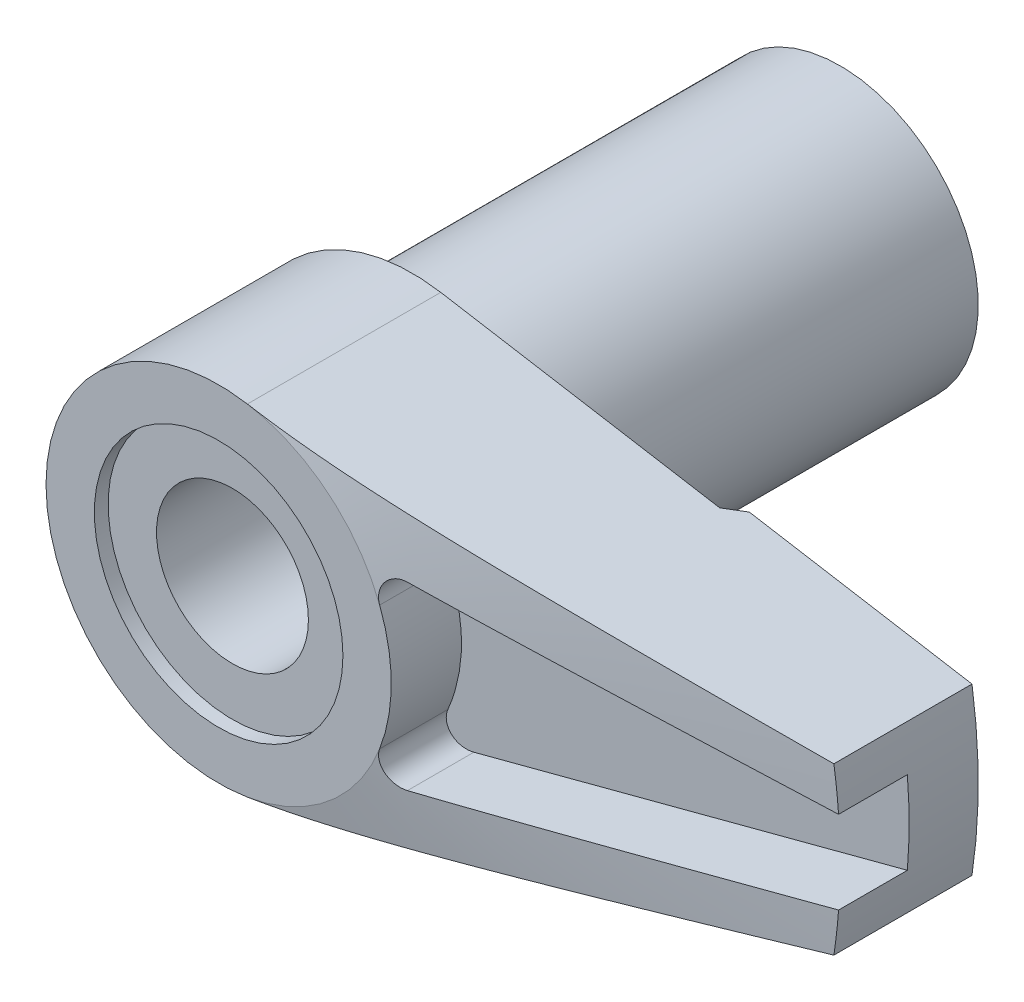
ISO-10303-21;
HEADER;
FILE_DESCRIPTION(('STEP AP214'),'2;1');
FILE_NAME('part.step','',(''),(''),'','','');
FILE_SCHEMA(('AUTOMOTIVE_DESIGN { 1 0 10303 214 1 1 1 1 }'));
ENDSEC;
DATA;
#1=APPLICATION_CONTEXT('core data for automotive mechanical design processes');
#2=APPLICATION_PROTOCOL_DEFINITION('international standard','automotive_design',2000,#1);
#3=PRODUCT_CONTEXT('',#1,'mechanical');
#4=PRODUCT('Part','Part','',(#3));
#5=PRODUCT_RELATED_PRODUCT_CATEGORY('part','',(#4));
#6=PRODUCT_DEFINITION_FORMATION('','',#4);
#7=PRODUCT_DEFINITION_CONTEXT('part definition',#1,'design');
#8=PRODUCT_DEFINITION('design','',#6,#7);
#9=PRODUCT_DEFINITION_SHAPE('','',#8);
#10=(LENGTH_UNIT() NAMED_UNIT(*) SI_UNIT(.MILLI.,.METRE.));
#11=(NAMED_UNIT(*) PLANE_ANGLE_UNIT() SI_UNIT($,.RADIAN.));
#12=(NAMED_UNIT(*) SI_UNIT($,.STERADIAN.) SOLID_ANGLE_UNIT());
#13=UNCERTAINTY_MEASURE_WITH_UNIT(LENGTH_MEASURE(1.E-05),#10,'distance_accuracy_value','');
#14=(GEOMETRIC_REPRESENTATION_CONTEXT(3) GLOBAL_UNCERTAINTY_ASSIGNED_CONTEXT((#13)) GLOBAL_UNIT_ASSIGNED_CONTEXT((#10,
#11,#12)) REPRESENTATION_CONTEXT('',''));
#15=CARTESIAN_POINT('',(0.,0.,0.));
#16=DIRECTION('',(0.,0.,1.));
#17=DIRECTION('',(1.,0.,0.));
#18=AXIS2_PLACEMENT_3D('',#15,#16,#17);
#19=CARTESIAN_POINT('',(39.8873413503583,-3.,45.));
#20=DIRECTION('',(0.131558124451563,-0.991308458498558,0.));
#21=DIRECTION('',(0.991308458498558,0.131558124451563,0.));
#22=AXIS2_PLACEMENT_3D('',#19,#20,#21);
#23=PLANE('',#22);
#24=CARTESIAN_POINT('',(56.3741060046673,-0.812015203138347,37.0218265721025));
#25=CARTESIAN_POINT('',(55.2157807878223,-0.96573838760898,37.23200458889));
#26=CARTESIAN_POINT('',(54.0574320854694,-1.11946468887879,37.4420509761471));
#27=CARTESIAN_POINT('',(51.7406752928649,-1.426925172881,37.8618132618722));
#28=CARTESIAN_POINT('',(50.5822672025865,-1.58065935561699,38.0715291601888));
#29=CARTESIAN_POINT('',(47.1057881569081,-2.04202842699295,38.7002877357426));
#30=CARTESIAN_POINT('',(44.7876109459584,-2.34967741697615,39.1187327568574));
#31=CARTESIAN_POINT('',(40.1221110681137,-2.96884333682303,39.9583350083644));
#32=CARTESIAN_POINT('',(37.7747829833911,-3.28036098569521,40.3794616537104));
#33=CARTESIAN_POINT('',(34.2538000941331,-3.74763623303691,41.0077927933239));
#34=CARTESIAN_POINT('',(33.0804309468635,-3.90335592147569,41.2166254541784));
#35=CARTESIAN_POINT('',(30.7334372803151,-4.21482918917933,41.6327964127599));
#36=CARTESIAN_POINT('',(29.5598127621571,-4.37058276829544,41.8401347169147));
#37=CARTESIAN_POINT('',(27.2391258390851,-4.6785648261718,42.2479977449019));
#38=CARTESIAN_POINT('',(26.09207159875,-4.83079222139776,42.4485696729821));
#39=CARTESIAN_POINT('',(23.7974533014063,-5.13531467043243,42.8468449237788));
#40=CARTESIAN_POINT('',(22.6498892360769,-5.28760972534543,43.0445481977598));
#41=CARTESIAN_POINT('',(20.3522972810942,-5.59252681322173,43.4359522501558));
#42=CARTESIAN_POINT('',(19.2022682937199,-5.74514899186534,43.6296465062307));
#43=CARTESIAN_POINT('',(17.4764114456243,-5.97419020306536,43.9149741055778));
#44=CARTESIAN_POINT('',(16.9010071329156,-6.05055302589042,44.0092116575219));
#45=CARTESIAN_POINT('',(15.7498359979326,-6.20332678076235,44.1954132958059));
#46=CARTESIAN_POINT('',(15.1740691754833,-6.27973771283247,44.2873773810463));
#47=CARTESIAN_POINT('',(14.0264439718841,-6.43204088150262,44.4676339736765));
#48=CARTESIAN_POINT('',(13.4545890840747,-6.50793265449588,44.5559490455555));
#49=CARTESIAN_POINT('',(12.3102925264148,-6.65979407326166,44.7286469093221));
#50=CARTESIAN_POINT('',(11.7378508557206,-6.73576371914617,44.8130296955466));
#51=CARTESIAN_POINT('',(10.5920151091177,-6.88782940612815,44.9764796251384));
#52=CARTESIAN_POINT('',(10.01862077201,-6.96392548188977,45.0555449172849));
#53=CARTESIAN_POINT('',(8.87086598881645,-7.11624584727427,45.2063105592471));
#54=CARTESIAN_POINT('',(8.29650553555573,-7.19247013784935,45.2780108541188));
#55=CARTESIAN_POINT('',(7.14809399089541,-7.34487766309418,45.4110541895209));
#56=CARTESIAN_POINT('',(6.5740459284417,-7.4210604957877,45.472423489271));
#57=CARTESIAN_POINT('',(5.4246111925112,-7.5736038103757,45.5813278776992));
#58=CARTESIAN_POINT('',(4.84922450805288,-7.64996429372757,45.6288628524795));
#59=CARTESIAN_POINT('',(3.98545859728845,-7.76459604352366,45.6866334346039));
#60=CARTESIAN_POINT('',(3.69752050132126,-7.802808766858,45.7036314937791));
#61=CARTESIAN_POINT('',(3.121400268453,-7.87926660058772,45.7326515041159));
#62=CARTESIAN_POINT('',(2.83321813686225,-7.91751171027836,45.7446735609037));
#63=CARTESIAN_POINT('',(2.25671320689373,-7.99402059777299,45.7633600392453));
#64=CARTESIAN_POINT('',(1.96839042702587,-8.0322843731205,45.7700250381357));
#65=CARTESIAN_POINT('',(1.39167596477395,-8.10882106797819,45.7777701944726));
#66=CARTESIAN_POINT('',(1.10328428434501,-8.14709398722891,45.7788504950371));
#67=CARTESIAN_POINT('',(0.646248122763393,-8.2077479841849,45.776110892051));
#68=CARTESIAN_POINT('',(0.477590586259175,-8.23013079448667,45.7741389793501));
#69=CARTESIAN_POINT('',(0.140301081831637,-8.27489302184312,45.7682999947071));
#70=CARTESIAN_POINT('',(-0.0283308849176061,-8.29727243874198,45.764432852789));
#71=CARTESIAN_POINT('',(-0.365608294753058,-8.34203306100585,45.7548456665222));
#72=CARTESIAN_POINT('',(-0.534253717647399,-8.36441426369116,45.7491249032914));
#73=CARTESIAN_POINT('',(-0.871473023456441,-8.40916717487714,45.7358964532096));
#74=CARTESIAN_POINT('',(-1.04004690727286,-8.43153888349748,45.728388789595));
#75=CARTESIAN_POINT('',(-1.54607216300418,-8.49869430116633,45.7032786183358));
#76=CARTESIAN_POINT('',(-1.88339898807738,-8.5434614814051,45.6831014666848));
#77=CARTESIAN_POINT('',(-2.55754226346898,-8.63292810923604,45.6366796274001));
#78=CARTESIAN_POINT('',(-2.8943588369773,-8.67762757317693,45.6104367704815));
#79=CARTESIAN_POINT('',(-3.23093273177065,-8.72229483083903,45.5815508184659));
#80=B_SPLINE_CURVE_WITH_KNOTS('',3,(#24,#25,#26,#27,#28,#29,#30,#31,#32,#33,#34,#35,#36,#37,#38,
#39,#40,#41,#42,#43,#44,#45,#46,#47,#48,#49,#50,#51,#52,#53,#54,#55,#56,#57,#58,#59,#60,#61,#62,
#63,#64,#65,#66,#67,#68,#69,#70,#71,#72,#73,#74,#75,#76,#77,#78,#79),.UNSPECIFIED.,.F.,.F.,(4,2,
2,2,2,2,2,2,2,2,2,2,2,2,2,2,2,2,2,2,2,2,2,2,2,2,2,4),(0.,3.56169993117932,7.1234014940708,
14.2503362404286,21.4655298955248,25.0713430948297,28.677140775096,32.2002363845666,
35.7233917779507,39.2518884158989,41.016033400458,42.7801792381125,44.5309390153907,
46.2817013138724,48.0330699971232,49.7844517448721,51.531312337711,53.2781873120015,
54.1510304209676,55.0238550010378,55.8965855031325,56.769293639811,57.2797274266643,
57.790180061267,58.3008308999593,58.8114750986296,59.8340594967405,60.856335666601),.UNSPECIFIED.);
#81=CARTESIAN_POINT('',(39.8873413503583,-3.,40.));
#82=VERTEX_POINT('',#81);
#83=CARTESIAN_POINT('',(13.2558319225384,-6.53431003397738,44.5856643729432));
#84=VERTEX_POINT('',#83);
#85=EDGE_CURVE('E35',#82,#84,#80,.T.);
#86=ORIENTED_EDGE('',*,*,#85,.F.);
#87=DIRECTION('',(0.,0.,-1.));
#88=VECTOR('',#87,1.);
#89=CARTESIAN_POINT('',(39.8873413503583,-3.,45.));
#90=LINE('',#89,#88);
#91=CARTESIAN_POINT('',(39.8873413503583,-3.,35.0201176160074));
#92=VERTEX_POINT('',#91);
#93=EDGE_CURVE('E323',#82,#92,#90,.T.);
#94=ORIENTED_EDGE('',*,*,#93,.T.);
#95=DIRECTION('',(0.976132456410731,0.129544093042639,-0.174309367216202));
#96=VECTOR('',#95,1.);
#97=CARTESIAN_POINT('',(38.1892740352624,-3.22535321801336,35.3233439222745));
#98=LINE('',#97,#96);
#99=CARTESIAN_POINT('',(13.2558319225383,-6.53431003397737,39.7757442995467));
#100=VERTEX_POINT('',#99);
#101=EDGE_CURVE('E318',#100,#92,#98,.T.);
#102=ORIENTED_EDGE('',*,*,#101,.F.);
#103=DIRECTION('',(0.,0.,1.));
#104=VECTOR('',#103,1.);
#105=CARTESIAN_POINT('',(13.2558319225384,-6.53431003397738,35.));
#106=LINE('',#105,#104);
#107=EDGE_CURVE('E349',#100,#84,#106,.T.);
#108=ORIENTED_EDGE('',*,*,#107,.T.);
#109=EDGE_LOOP('',(#86,#94,#102,#108));
#110=FACE_BOUND('',#109,.T.);
#111=ADVANCED_FACE('F14',(#110),#23,.F.);
#112=CARTESIAN_POINT('',(39.5474398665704,6.,-8.93955266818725));
#113=DIRECTION('',(0.166476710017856,0.986045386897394,0.));
#114=DIRECTION('',(-0.986045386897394,0.166476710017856,0.));
#115=AXIS2_PLACEMENT_3D('',#112,#113,#114);
#116=PLANE('',#115);
#117=DIRECTION('',(0.,0.,-1.));
#118=VECTOR('',#117,1.);
#119=CARTESIAN_POINT('',(2.0809588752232,12.3255673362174,80.3553390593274));
#120=LINE('',#119,#118);
#121=CARTESIAN_POINT('',(2.0809588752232,12.3255673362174,31.));
#122=VERTEX_POINT('',#121);
#123=CARTESIAN_POINT('',(2.0809588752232,12.3255673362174,45.));
#124=VERTEX_POINT('',#123);
#125=EDGE_CURVE('E139',#122,#124,#120,.F.);
#126=ORIENTED_EDGE('',*,*,#125,.T.);
#127=CARTESIAN_POINT('',(2.0807588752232,12.3256011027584,44.9999999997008));
#128=CARTESIAN_POINT('',(2.34089155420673,12.2816821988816,45.0000058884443));
#129=CARTESIAN_POINT('',(2.60102183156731,12.2377637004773,44.9984824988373));
#130=CARTESIAN_POINT('',(3.12124577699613,12.1499328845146,44.9924208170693));
#131=CARTESIAN_POINT('',(3.38133944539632,12.1060205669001,44.9878825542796));
#132=CARTESIAN_POINT('',(4.16145560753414,11.9743114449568,44.9698125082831));
#133=CARTESIAN_POINT('',(4.68138311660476,11.8865306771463,44.9518254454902));
#134=CARTESIAN_POINT('',(5.7202981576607,11.7111278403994,44.9048189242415));
#135=CARTESIAN_POINT('',(6.23928611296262,11.6235056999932,44.8758088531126));
#136=CARTESIAN_POINT('',(7.27664601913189,11.448365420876,44.8079497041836));
#137=CARTESIAN_POINT('',(7.79501795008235,11.3608472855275,44.7691003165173));
#138=CARTESIAN_POINT('',(8.83043435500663,11.1860351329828,44.6829536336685));
#139=CARTESIAN_POINT('',(9.34747967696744,11.0987409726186,44.6356667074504));
#140=CARTESIAN_POINT('',(10.380875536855,10.9242699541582,44.5339280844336));
#141=CARTESIAN_POINT('',(10.8972260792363,10.8370930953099,44.4794764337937));
#142=CARTESIAN_POINT('',(11.9294089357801,10.6628268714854,44.3645883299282));
#143=CARTESIAN_POINT('',(12.4452410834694,10.5757375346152,44.3041503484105));
#144=CARTESIAN_POINT('',(13.4763167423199,10.4016582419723,44.1783335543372));
#145=CARTESIAN_POINT('',(13.9915602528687,10.3146682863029,44.112954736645));
#146=CARTESIAN_POINT('',(15.0298761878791,10.1393665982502,43.9770292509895));
#147=CARTESIAN_POINT('',(15.5529401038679,10.0510563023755,43.9064159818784));
#148=CARTESIAN_POINT('',(16.5986019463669,9.87451438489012,43.7617192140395));
#149=CARTESIAN_POINT('',(17.1211998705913,9.78628276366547,43.6876356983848));
#150=CARTESIAN_POINT('',(18.6884085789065,9.52168667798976,43.4611133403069));
#151=CARTESIAN_POINT('',(19.7324189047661,9.34542359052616,43.3044047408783));
#152=CARTESIAN_POINT('',(21.8192291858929,8.99310176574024,42.983139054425));
#153=CARTESIAN_POINT('',(22.8620291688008,8.81704302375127,42.8185821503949));
#154=CARTESIAN_POINT('',(24.9467575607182,8.46507268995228,42.4838690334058));
#155=CARTESIAN_POINT('',(25.9886859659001,8.28916109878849,42.3137127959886));
#156=CARTESIAN_POINT('',(28.0744453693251,7.9370166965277,41.9688969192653));
#157=CARTESIAN_POINT('',(29.1182747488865,7.7607841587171,41.7942272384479));
#158=CARTESIAN_POINT('',(31.2054334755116,7.40840350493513,41.441823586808));
#159=CARTESIAN_POINT('',(32.2487628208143,7.23225538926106,41.2640896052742));
#160=CARTESIAN_POINT('',(34.334861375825,6.8800537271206,40.9063216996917));
#161=CARTESIAN_POINT('',(35.3776306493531,6.70400016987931,40.7262881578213));
#162=CARTESIAN_POINT('',(37.4628518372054,6.35194663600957,40.3643830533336));
#163=CARTESIAN_POINT('',(38.5053037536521,6.17594665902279,40.1825115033));
#164=CARTESIAN_POINT('',(39.5476398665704,5.99996623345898,39.9999649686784));
#165=B_SPLINE_CURVE_WITH_KNOTS('',3,(#127,#128,#129,#130,#131,#132,#133,#134,#135,#136,#137,
#138,#139,#140,#141,#142,#143,#144,#145,#146,#147,#148,#149,#150,#151,#152,#153,#154,#155,#156,
#157,#158,#159,#160,#161,#162,#163,#164),.UNSPECIFIED.,.F.,.F.,(4,2,2,2,2,2,2,2,2,2,2,2,2,2,2,2,
2,2,4),(0.,0.791433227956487,1.58285874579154,3.16549729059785,4.74679105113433,
6.32813461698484,7.9075480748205,9.48695135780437,11.0667589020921,12.6465680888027,
14.251990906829,15.857421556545,19.0683300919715,22.2791637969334,25.4900115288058,
28.7087516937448,31.9275031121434,35.1457263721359,38.363927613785),.UNSPECIFIED.);
#166=CARTESIAN_POINT('',(39.5474398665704,6.,40.));
#167=VERTEX_POINT('',#166);
#168=EDGE_CURVE('E110',#124,#167,#165,.T.);
#169=ORIENTED_EDGE('',*,*,#168,.T.);
#170=DIRECTION('',(0.,0.,-1.));
#171=VECTOR('',#170,1.);
#172=CARTESIAN_POINT('',(39.5474398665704,6.,45.));
#173=LINE('',#172,#171);
#174=CARTESIAN_POINT('',(39.5474398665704,6.,30.));
#175=VERTEX_POINT('',#174);
#176=EDGE_CURVE('E301',#167,#175,#173,.T.);
#177=ORIENTED_EDGE('',*,*,#176,.T.);
#178=DIRECTION('',(0.986045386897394,-0.166476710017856,0.));
#179=VECTOR('',#178,1.);
#180=CARTESIAN_POINT('',(39.5474398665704,6.,30.));
#181=LINE('',#180,#179);
#182=CARTESIAN_POINT('',(23.4294677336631,8.72124083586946,30.));
#183=VERTEX_POINT('',#182);
#184=EDGE_CURVE('E142',#183,#175,#181,.T.);
#185=ORIENTED_EDGE('',*,*,#184,.F.);
#186=CARTESIAN_POINT('',(38.797623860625,6.12659346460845,15.7216247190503));
#187=CARTESIAN_POINT('',(38.1940432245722,6.22849761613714,16.301905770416));
#188=CARTESIAN_POINT('',(37.589764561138,6.33051961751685,16.8814417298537));
#189=CARTESIAN_POINT('',(36.3795574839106,6.53484215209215,18.0387464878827));
#190=CARTESIAN_POINT('',(35.773629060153,6.63714268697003,18.6165152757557));
#191=CARTESIAN_POINT('',(34.5590520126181,6.84220301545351,19.7707848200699));
#192=CARTESIAN_POINT('',(33.9504008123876,6.94496324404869,20.347282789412));
#193=CARTESIAN_POINT('',(32.7308776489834,7.15085863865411,21.4978561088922));
#194=CARTESIAN_POINT('',(32.1200056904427,7.25399380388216,22.071931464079));
#195=CARTESIAN_POINT('',(30.8645981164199,7.46594766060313,23.2462562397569));
#196=CARTESIAN_POINT('',(30.2199266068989,7.57478929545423,23.8463563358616));
#197=CARTESIAN_POINT('',(28.9271264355,7.79305624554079,25.042723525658));
#198=CARTESIAN_POINT('',(28.2789977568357,7.90248156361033,25.6389906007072));
#199=CARTESIAN_POINT('',(26.9793955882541,8.12189691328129,26.8260570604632));
#200=CARTESIAN_POINT('',(26.327927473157,8.23188603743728,27.4168624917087));
#201=CARTESIAN_POINT('',(25.0198930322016,8.45272503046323,28.5926298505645));
#202=CARTESIAN_POINT('',(24.3633267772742,8.56357488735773,29.1775918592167));
#203=CARTESIAN_POINT('',(23.0450327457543,8.78614603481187,30.339090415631));
#204=CARTESIAN_POINT('',(22.3833162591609,8.89786541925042,30.9156401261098));
#205=CARTESIAN_POINT('',(21.051894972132,9.12265287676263,32.0592957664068));
#206=CARTESIAN_POINT('',(20.3821896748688,9.23572103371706,32.6264011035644));
#207=CARTESIAN_POINT('',(19.3685897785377,9.40684984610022,33.468800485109));
#208=CARTESIAN_POINT('',(19.028496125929,9.4642687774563,33.7488001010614));
#209=CARTESIAN_POINT('',(18.345379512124,9.57960120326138,34.3050968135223));
#210=CARTESIAN_POINT('',(18.002356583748,9.63751469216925,34.5813939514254));
#211=CARTESIAN_POINT('',(17.3130203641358,9.75389719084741,35.1296161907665));
#212=CARTESIAN_POINT('',(16.9667076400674,9.81236610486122,35.4015420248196));
#213=CARTESIAN_POINT('',(16.270239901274,9.92995263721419,35.9402915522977));
#214=CARTESIAN_POINT('',(15.9200848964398,9.98907025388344,36.207115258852));
#215=CARTESIAN_POINT('',(15.2240874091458,10.1065773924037,36.7281509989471));
#216=CARTESIAN_POINT('',(14.8783533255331,10.1649486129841,36.9825116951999));
#217=CARTESIAN_POINT('',(14.1820357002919,10.28250980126,37.4843380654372));
#218=CARTESIAN_POINT('',(13.8314520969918,10.3416997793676,37.7318036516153));
#219=CARTESIAN_POINT('',(13.1243622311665,10.4610796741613,38.2186506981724));
#220=CARTESIAN_POINT('',(12.7678506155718,10.5212704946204,38.4580241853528));
#221=CARTESIAN_POINT('',(12.0483918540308,10.6427386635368,38.9266240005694));
#222=CARTESIAN_POINT('',(11.6854448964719,10.7040159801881,39.1558506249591));
#223=CARTESIAN_POINT('',(10.9547983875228,10.8273730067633,39.6002487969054));
#224=CARTESIAN_POINT('',(10.5871519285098,10.8894437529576,39.8155097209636));
#225=CARTESIAN_POINT('',(9.84352155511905,11.0149928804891,40.230913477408));
#226=CARTESIAN_POINT('',(9.46753641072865,11.0784714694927,40.4310540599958));
#227=CARTESIAN_POINT('',(8.70707829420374,11.2068616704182,40.8121607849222));
#228=CARTESIAN_POINT('',(8.32262305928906,11.2717702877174,40.993163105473));
#229=CARTESIAN_POINT('',(7.54393660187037,11.4032380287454,41.3318713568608));
#230=CARTESIAN_POINT('',(7.1497103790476,11.4697963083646,41.4895889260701));
#231=CARTESIAN_POINT('',(6.57011701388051,11.5676506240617,41.6978298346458));
#232=CARTESIAN_POINT('',(6.38869507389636,11.5982805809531,41.7597287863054));
#233=CARTESIAN_POINT('',(6.0238509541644,11.659878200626,41.8771672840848));
#234=CARTESIAN_POINT('',(5.84042865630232,11.6908458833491,41.93270645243));
#235=CARTESIAN_POINT('',(5.28715438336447,11.7842566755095,42.0890066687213));
#236=CARTESIAN_POINT('',(4.91437541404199,11.8471939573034,42.1794210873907));
#237=CARTESIAN_POINT('',(4.16449751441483,11.9737978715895,42.3281176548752));
#238=CARTESIAN_POINT('',(3.7874291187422,12.0374593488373,42.3865567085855));
#239=CARTESIAN_POINT('',(3.02961620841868,12.1654029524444,42.4688484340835));
#240=CARTESIAN_POINT('',(2.6488721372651,12.2296850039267,42.4927052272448));
#241=CARTESIAN_POINT('',(1.88520861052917,12.3586163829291,42.5044459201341));
#242=CARTESIAN_POINT('',(1.50228681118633,12.4232661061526,42.4921756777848));
#243=CARTESIAN_POINT('',(0.739193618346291,12.5521011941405,42.4320749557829));
#244=CARTESIAN_POINT('',(0.359022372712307,12.6162865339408,42.3842425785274));
#245=CARTESIAN_POINT('',(-0.397719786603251,12.7440493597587,42.2553921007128));
#246=CARTESIAN_POINT('',(-0.774262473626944,12.8076220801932,42.1742060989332));
#247=CARTESIAN_POINT('',(-1.51997756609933,12.9335231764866,41.9826111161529));
#248=CARTESIAN_POINT('',(-1.88914935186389,12.9958514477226,41.872199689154));
#249=CARTESIAN_POINT('',(-2.63606709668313,13.121955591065,41.6208736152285));
#250=CARTESIAN_POINT('',(-3.01342652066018,13.1856662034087,41.4787896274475));
#251=CARTESIAN_POINT('',(-3.75922296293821,13.3115810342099,41.1721172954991));
#252=CARTESIAN_POINT('',(-4.12765644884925,13.3737846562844,41.0075202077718));
#253=CARTESIAN_POINT('',(-4.85650855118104,13.4968387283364,40.6597139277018));
#254=CARTESIAN_POINT('',(-5.2169139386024,13.5576869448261,40.4764764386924));
#255=CARTESIAN_POINT('',(-5.92984080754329,13.6780523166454,40.0950401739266));
#256=CARTESIAN_POINT('',(-6.28236319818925,13.7375696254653,39.8968431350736));
#257=CARTESIAN_POINT('',(-6.98158094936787,13.8556204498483,39.4875341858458));
#258=CARTESIAN_POINT('',(-7.32825286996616,13.9141500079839,39.2763812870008));
#259=CARTESIAN_POINT('',(-8.01540001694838,14.0301629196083,38.8439651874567));
#260=CARTESIAN_POINT('',(-8.35587507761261,14.0876462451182,38.6227017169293));
#261=CARTESIAN_POINT('',(-9.0311138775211,14.2016486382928,38.1720036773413));
#262=CARTESIAN_POINT('',(-9.36588201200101,14.2581684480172,37.9425758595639));
#263=CARTESIAN_POINT('',(-10.0306628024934,14.3704051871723,37.4767766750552));
#264=CARTESIAN_POINT('',(-10.3606756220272,14.4261221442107,37.2404055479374));
#265=CARTESIAN_POINT('',(-10.8157715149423,14.5029572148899,36.9083255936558));
#266=CARTESIAN_POINT('',(-10.9426223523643,14.5243737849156,36.815096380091));
#267=CARTESIAN_POINT('',(-11.1957314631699,14.5671068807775,36.627811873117));
#268=CARTESIAN_POINT('',(-11.3219897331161,14.5884234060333,36.5337565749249));
#269=CARTESIAN_POINT('',(-11.5734159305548,14.630872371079,36.3452676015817));
#270=CARTESIAN_POINT('',(-11.6985862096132,14.6520052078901,36.2508371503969));
#271=CARTESIAN_POINT('',(-11.9483938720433,14.6941809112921,36.0612562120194));
#272=CARTESIAN_POINT('',(-12.0730312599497,14.7152237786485,35.9661057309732));
#273=CARTESIAN_POINT('',(-12.1974164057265,14.7362240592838,35.8706177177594));
#274=B_SPLINE_CURVE_WITH_KNOTS('',3,(#186,#187,#188,#189,#190,#191,#192,#193,#194,#195,#196,
#197,#198,#199,#200,#201,#202,#203,#204,#205,#206,#207,#208,#209,#210,#211,#212,#213,#214,#215,
#216,#217,#218,#219,#220,#221,#222,#223,#224,#225,#226,#227,#228,#229,#230,#231,#232,#233,#234,
#235,#236,#237,#238,#239,#240,#241,#242,#243,#244,#245,#246,#247,#248,#249,#250,#251,#252,#253,
#254,#255,#256,#257,#258,#259,#260,#261,#262,#263,#264,#265,#266,#267,#268,#269,#270,#271,#272,
#273),.UNSPECIFIED.,.F.,.F.,(4,2,2,2,2,2,2,2,2,2,2,2,2,2,2,2,2,2,2,2,2,2,2,2,2,2,2,2,2,2,2,2,2,
2,2,2,2,2,2,2,2,2,2,4),(0.,2.53037283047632,5.06076097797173,7.59458504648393,10.1284038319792,
12.7907421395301,15.4530933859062,18.1120200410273,20.7709097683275,23.4250587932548,
26.0793737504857,27.4121115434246,28.7448344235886,30.0773315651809,31.4098252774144,
32.7092741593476,34.0087395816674,35.3094501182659,36.6101226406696,37.901422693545,
39.1929145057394,40.481919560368,41.770278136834,42.3525454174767,42.9348472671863,
44.0997102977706,45.2588048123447,46.4177611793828,47.5816695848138,48.7456401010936,
49.9155432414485,51.0855443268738,52.309355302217,53.5336429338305,54.7598176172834,
55.9858501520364,57.215984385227,58.4461514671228,59.6753239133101,60.9044539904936,
61.381079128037,61.8577070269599,62.3323430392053,62.8069750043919),.UNSPECIFIED.);
#275=CARTESIAN_POINT('',(22.2828607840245,8.91482558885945,31.));
#276=VERTEX_POINT('',#275);
#277=EDGE_CURVE('E174',#183,#276,#274,.T.);
#278=ORIENTED_EDGE('',*,*,#277,.T.);
#279=DIRECTION('',(-0.986045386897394,0.166476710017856,0.));
#280=VECTOR('',#279,1.);
#281=CARTESIAN_POINT('',(39.5474398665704,6.,31.));
#282=LINE('',#281,#280);
#283=EDGE_CURVE('E147',#276,#122,#282,.T.);
#284=ORIENTED_EDGE('',*,*,#283,.T.);
#285=EDGE_LOOP('',(#126,#169,#177,#185,#278,#284));
#286=FACE_BOUND('',#285,.T.);
#287=ADVANCED_FACE('F144',(#286),#116,.T.);
#288=CARTESIAN_POINT('',(39.5474398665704,-6.,-8.93955266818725));
#289=DIRECTION('',(0.166476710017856,-0.986045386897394,0.));
#290=DIRECTION('',(0.986045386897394,0.166476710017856,0.));
#291=AXIS2_PLACEMENT_3D('',#288,#289,#290);
#292=PLANE('',#291);
#293=DIRECTION('',(0.,0.,-1.));
#294=VECTOR('',#293,1.);
#295=CARTESIAN_POINT('',(39.5474398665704,-6.,45.));
#296=LINE('',#295,#294);
#297=CARTESIAN_POINT('',(39.5474398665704,-6.,40.));
#298=VERTEX_POINT('',#297);
#299=CARTESIAN_POINT('',(39.5474398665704,-6.,30.));
#300=VERTEX_POINT('',#299);
#301=EDGE_CURVE('E299',#298,#300,#296,.T.);
#302=ORIENTED_EDGE('',*,*,#301,.F.);
#303=CARTESIAN_POINT('',(39.5476398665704,-5.99996623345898,39.9999649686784));
#304=CARTESIAN_POINT('',(38.7714238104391,-6.131016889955,40.1359172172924));
#305=CARTESIAN_POINT('',(37.9951415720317,-6.26207872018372,40.2714821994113));
#306=CARTESIAN_POINT('',(36.442414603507,-6.52422981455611,40.5416560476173));
#307=CARTESIAN_POINT('',(35.6659698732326,-6.65531907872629,40.676264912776));
#308=CARTESIAN_POINT('',(34.1130088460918,-6.91750968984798,40.944324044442));
#309=CARTESIAN_POINT('',(33.3364925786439,-7.04861103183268,41.0777744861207));
#310=CARTESIAN_POINT('',(31.7832302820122,-7.31085250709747,41.3432937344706));
#311=CARTESIAN_POINT('',(31.0064842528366,-7.4419926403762,41.475362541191));
#312=CARTESIAN_POINT('',(29.4535791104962,-7.70417381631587,41.7376612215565));
#313=CARTESIAN_POINT('',(28.6774203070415,-7.83521480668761,41.8678929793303));
#314=CARTESIAN_POINT('',(27.124763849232,-8.09735399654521,42.1262614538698));
#315=CARTESIAN_POINT('',(26.3482661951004,-8.22845219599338,42.2543981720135));
#316=CARTESIAN_POINT('',(24.7947192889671,-8.49074172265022,42.5080614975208));
#317=CARTESIAN_POINT('',(24.0176699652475,-8.62193306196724,42.6335876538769));
#318=CARTESIAN_POINT('',(22.4630487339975,-8.8844039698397,42.8812869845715));
#319=CARTESIAN_POINT('',(21.68547682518,-9.01568353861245,43.0034601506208));
#320=CARTESIAN_POINT('',(20.1282029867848,-9.27860229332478,43.2437028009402));
#321=CARTESIAN_POINT('',(19.3484998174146,-9.41024168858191,43.3617640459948));
#322=CARTESIAN_POINT('',(17.7882761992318,-9.67365846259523,43.5921872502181));
#323=CARTESIAN_POINT('',(17.007755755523,-9.80543584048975,43.7045492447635));
#324=CARTESIAN_POINT('',(15.446000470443,-10.0691112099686,43.9216689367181));
#325=CARTESIAN_POINT('',(14.6647660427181,-10.201009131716,44.0264296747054));
#326=CARTESIAN_POINT('',(13.1010033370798,-10.465023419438,44.225849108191));
#327=CARTESIAN_POINT('',(12.318475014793,-10.5971397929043,44.3205074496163));
#328=CARTESIAN_POINT('',(10.75077514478,-10.8618188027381,44.4964415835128));
#329=CARTESIAN_POINT('',(9.96560140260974,-10.9943818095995,44.5776975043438));
#330=CARTESIAN_POINT('',(8.39369949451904,-11.2597702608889,44.7223380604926));
#331=CARTESIAN_POINT('',(7.60697152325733,-11.3925956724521,44.7857248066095));
#332=CARTESIAN_POINT('',(6.42525284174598,-11.5921084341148,44.8639176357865));
#333=CARTESIAN_POINT('',(6.03080091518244,-11.658704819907,44.8871776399));
#334=CARTESIAN_POINT('',(5.24158987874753,-11.7919494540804,44.927509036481));
#335=CARTESIAN_POINT('',(4.84683077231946,-11.8585977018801,44.9445804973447));
#336=CARTESIAN_POINT('',(4.05692183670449,-11.99196016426,44.9720890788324));
#337=CARTESIAN_POINT('',(3.66177191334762,-12.058674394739,44.9825234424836));
#338=CARTESIAN_POINT('',(2.87133573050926,-12.1921258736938,44.9964965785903));
#339=CARTESIAN_POINT('',(2.47604946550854,-12.2588631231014,45.0000350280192));
#340=CARTESIAN_POINT('',(2.0807588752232,-12.3256011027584,44.9999999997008));
#341=B_SPLINE_CURVE_WITH_KNOTS('',3,(#303,#304,#305,#306,#307,#308,#309,#310,#311,#312,#313,
#314,#315,#316,#317,#318,#319,#320,#321,#322,#323,#324,#325,#326,#327,#328,#329,#330,#331,#332,
#333,#334,#335,#336,#337,#338,#339,#340),.UNSPECIFIED.,.F.,.F.,(4,2,2,2,2,2,2,2,2,2,2,2,2,2,2,2,
2,2,4),(0.,2.39656401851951,4.79313036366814,7.18932776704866,9.5855250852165,11.979053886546,
14.3725811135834,16.7665184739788,19.1604617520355,21.5589541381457,23.95743163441,
26.3549443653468,28.7525410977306,31.1536613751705,33.5544979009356,34.7565874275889,
35.9586636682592,37.1612389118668,38.3638704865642),.UNSPECIFIED.);
#342=CARTESIAN_POINT('',(2.0809588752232,-12.3255673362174,45.));
#343=VERTEX_POINT('',#342);
#344=EDGE_CURVE('E225',#298,#343,#341,.T.);
#345=ORIENTED_EDGE('',*,*,#344,.T.);
#346=DIRECTION('',(0.,0.,-1.));
#347=VECTOR('',#346,1.);
#348=CARTESIAN_POINT('',(2.0809588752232,-12.3255673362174,80.3553390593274));
#349=LINE('',#348,#347);
#350=CARTESIAN_POINT('',(2.0809588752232,-12.3255673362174,31.));
#351=VERTEX_POINT('',#350);
#352=EDGE_CURVE('E141',#351,#343,#349,.F.);
#353=ORIENTED_EDGE('',*,*,#352,.F.);
#354=DIRECTION('',(0.986045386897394,0.166476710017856,0.));
#355=VECTOR('',#354,1.);
#356=CARTESIAN_POINT('',(39.5474398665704,-6.,31.));
#357=LINE('',#356,#355);
#358=CARTESIAN_POINT('',(22.2828607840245,-8.91482558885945,31.));
#359=VERTEX_POINT('',#358);
#360=EDGE_CURVE('E28',#351,#359,#357,.T.);
#361=ORIENTED_EDGE('',*,*,#360,.T.);
#362=CARTESIAN_POINT('',(-12.1974164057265,-14.7362240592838,35.8706177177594));
#363=CARTESIAN_POINT('',(-12.0187498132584,-14.706059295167,36.0077750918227));
#364=CARTESIAN_POINT('',(-11.8395645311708,-14.6758069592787,36.1442369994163));
#365=CARTESIAN_POINT('',(-11.4800683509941,-14.6151122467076,36.4156344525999));
#366=CARTESIAN_POINT('',(-11.2997574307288,-14.5846698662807,36.5505699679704));
#367=CARTESIAN_POINT('',(-10.7569207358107,-14.493021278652,36.9529451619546));
#368=CARTESIAN_POINT('',(-10.3925835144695,-14.4315092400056,37.2178822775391));
#369=CARTESIAN_POINT('',(-9.65500258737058,-14.3069814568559,37.7420470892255));
#370=CARTESIAN_POINT('',(-9.28170814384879,-14.2439571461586,38.0012015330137));
#371=CARTESIAN_POINT('',(-8.52853290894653,-14.1167965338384,38.5094414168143));
#372=CARTESIAN_POINT('',(-8.14865263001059,-14.0526603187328,38.7585276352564));
#373=CARTESIAN_POINT('',(-7.35717332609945,-13.9190327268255,39.2595105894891));
#374=CARTESIAN_POINT('',(-6.94507817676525,-13.8494575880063,39.5106057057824));
#375=CARTESIAN_POINT('',(-6.11073881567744,-13.7085938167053,39.9951234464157));
#376=CARTESIAN_POINT('',(-5.68849273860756,-13.6373048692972,40.2285427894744));
#377=CARTESIAN_POINT('',(-4.83400025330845,-13.4930385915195,40.6720002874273));
#378=CARTESIAN_POINT('',(-4.40179442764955,-13.420068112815,40.8821181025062));
#379=CARTESIAN_POINT('',(-3.52504255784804,-13.2720437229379,41.2736081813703));
#380=CARTESIAN_POINT('',(-3.08050322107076,-13.196990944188,41.4549957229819));
#381=CARTESIAN_POINT('',(-2.20326052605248,-13.0488836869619,41.772565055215));
#382=CARTESIAN_POINT('',(-1.7712541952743,-12.9759468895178,41.9106866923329));
#383=CARTESIAN_POINT('',(-1.11545954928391,-12.8652273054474,42.0882765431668));
#384=CARTESIAN_POINT('',(-0.895524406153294,-12.8280950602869,42.1425480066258));
#385=CARTESIAN_POINT('',(-0.453361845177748,-12.7534435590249,42.240375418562));
#386=CARTESIAN_POINT('',(-0.231134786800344,-12.7159243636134,42.2839330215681));
#387=CARTESIAN_POINT('',(0.210985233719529,-12.6412800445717,42.3588549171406));
#388=CARTESIAN_POINT('',(0.430842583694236,-12.6041609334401,42.3904347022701));
#389=CARTESIAN_POINT('',(0.871851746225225,-12.5297041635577,42.4419633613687));
#390=CARTESIAN_POINT('',(1.09300334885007,-12.4923665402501,42.4619140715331));
#391=CARTESIAN_POINT('',(1.53604334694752,-12.4175668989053,42.4897991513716));
#392=CARTESIAN_POINT('',(1.75793173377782,-12.3801048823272,42.4977336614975));
#393=CARTESIAN_POINT('',(2.20180810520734,-12.3051640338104,42.5014255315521));
#394=CARTESIAN_POINT('',(2.42379609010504,-12.2676852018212,42.4971828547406));
#395=CARTESIAN_POINT('',(2.86842231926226,-12.1926177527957,42.4765510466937));
#396=CARTESIAN_POINT('',(3.09105759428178,-12.1550296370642,42.4600963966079));
#397=CARTESIAN_POINT('',(3.53515529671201,-12.0800514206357,42.415297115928));
#398=CARTESIAN_POINT('',(3.75661771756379,-12.0426613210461,42.3869524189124));
#399=CARTESIAN_POINT('',(4.1978524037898,-11.9681664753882,42.3189090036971));
#400=CARTESIAN_POINT('',(4.41762453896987,-11.9310617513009,42.2792094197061));
#401=CARTESIAN_POINT('',(4.85504741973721,-11.8572104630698,42.1891564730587));
#402=CARTESIAN_POINT('',(5.07269780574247,-11.8204639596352,42.1388013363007));
#403=CARTESIAN_POINT('',(5.72657028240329,-11.7100689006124,41.9717552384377));
#404=CARTESIAN_POINT('',(6.15908385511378,-11.6370464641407,41.8398248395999));
#405=CARTESIAN_POINT('',(6.79911909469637,-11.5289875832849,41.6170198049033));
#406=CARTESIAN_POINT('',(7.01102454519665,-11.4932110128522,41.5385927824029));
#407=CARTESIAN_POINT('',(7.43200755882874,-11.422135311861,41.3742465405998));
#408=CARTESIAN_POINT('',(7.64108506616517,-11.3868361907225,41.2883271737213));
#409=CARTESIAN_POINT('',(8.37240435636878,-11.2633655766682,40.9739942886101));
#410=CARTESIAN_POINT('',(8.88718889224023,-11.1764531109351,40.7276502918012));
#411=CARTESIAN_POINT('',(9.900808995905,-11.0053208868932,40.2031226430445));
#412=CARTESIAN_POINT('',(10.3996344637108,-10.9211028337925,39.924919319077));
#413=CARTESIAN_POINT('',(11.3845838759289,-10.7548111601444,39.3440309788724));
#414=CARTESIAN_POINT('',(11.870677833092,-10.6727426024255,39.041294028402));
#415=CARTESIAN_POINT('',(12.8312060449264,-10.5105740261,38.4177168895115));
#416=CARTESIAN_POINT('',(13.3056428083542,-10.4304735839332,38.096880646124));
#417=CARTESIAN_POINT('',(14.2489503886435,-10.2712124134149,37.4384214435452));
#418=CARTESIAN_POINT('',(14.717739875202,-10.1920654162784,37.1006791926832));
#419=CARTESIAN_POINT('',(15.6473094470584,-10.0351236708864,36.4140443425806));
#420=CARTESIAN_POINT('',(16.1080892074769,-9.95732897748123,36.0651512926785));
#421=CARTESIAN_POINT('',(17.0223651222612,-9.80296930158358,35.3589962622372));
#422=CARTESIAN_POINT('',(17.4758703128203,-9.72640279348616,35.0017462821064));
#423=CARTESIAN_POINT('',(18.3773234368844,-9.5742080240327,34.280136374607));
#424=CARTESIAN_POINT('',(18.8252714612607,-9.49857974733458,33.9157765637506));
#425=CARTESIAN_POINT('',(19.7046189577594,-9.35011713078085,33.1910330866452));
#426=CARTESIAN_POINT('',(20.1361412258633,-9.27726205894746,32.8308024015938));
#427=CARTESIAN_POINT('',(20.9954279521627,-9.13218635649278,32.1057559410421));
#428=CARTESIAN_POINT('',(21.4231923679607,-9.05996573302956,31.7409401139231));
#429=CARTESIAN_POINT('',(22.2755180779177,-8.91606527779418,31.0074463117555));
#430=CARTESIAN_POINT('',(22.7000792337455,-8.84438546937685,30.6387681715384));
#431=CARTESIAN_POINT('',(23.5464236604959,-8.70149485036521,29.8981451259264));
#432=CARTESIAN_POINT('',(23.9682069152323,-8.63028404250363,29.5262002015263));
#433=CARTESIAN_POINT('',(25.2305485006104,-8.41715949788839,28.405675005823));
#434=CARTESIAN_POINT('',(26.0675034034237,-8.2758541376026,27.6529189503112));
#435=CARTESIAN_POINT('',(27.7340905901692,-7.99447971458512,26.1391164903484));
#436=CARTESIAN_POINT('',(28.5637227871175,-7.85441066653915,25.3780699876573));
#437=CARTESIAN_POINT('',(29.7867330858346,-7.64792652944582,24.2475516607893));
#438=CARTESIAN_POINT('',(30.1823229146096,-7.58113802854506,23.8805365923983));
#439=CARTESIAN_POINT('',(30.9723162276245,-7.44776132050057,23.1452011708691));
#440=CARTESIAN_POINT('',(31.3667197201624,-7.38117311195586,22.7768808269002));
#441=CARTESIAN_POINT('',(32.5483518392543,-7.18167496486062,21.6701685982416));
#442=CARTESIAN_POINT('',(33.3339934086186,-7.04903297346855,20.9300335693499));
#443=CARTESIAN_POINT('',(34.9009192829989,-6.78448463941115,19.446913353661));
#444=CARTESIAN_POINT('',(35.6822076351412,-6.65257761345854,18.7039325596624));
#445=CARTESIAN_POINT('',(37.2419180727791,-6.38924748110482,17.2149138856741));
#446=CARTESIAN_POINT('',(38.0203402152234,-6.2578243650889,16.4688760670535));
#447=CARTESIAN_POINT('',(38.797623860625,-6.12659346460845,15.7216247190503));
#448=B_SPLINE_CURVE_WITH_KNOTS('',3,(#362,#363,#364,#365,#366,#367,#368,#369,#370,#371,#372,
#373,#374,#375,#376,#377,#378,#379,#380,#381,#382,#383,#384,#385,#386,#387,#388,#389,#390,#391,
#392,#393,#394,#395,#396,#397,#398,#399,#400,#401,#402,#403,#404,#405,#406,#407,#408,#409,#410,
#411,#412,#413,#414,#415,#416,#417,#418,#419,#420,#421,#422,#423,#424,#425,#426,#427,#428,#429,
#430,#431,#432,#433,#434,#435,#436,#437,#438,#439,#440,#441,#442,#443,#444,#445,#446,#447),
.UNSPECIFIED.,.F.,.F.,(4,2,2,2,2,2,2,2,2,2,2,2,2,2,2,2,2,2,2,2,2,2,2,2,2,2,2,2,2,2,2,2,2,2,2,2,
2,2,2,2,2,2,4),(0.,0.681755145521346,1.36352376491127,2.72741425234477,4.10363276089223,
5.47974466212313,6.94207139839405,8.40466893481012,9.86210126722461,11.3187559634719,
12.6951660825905,13.383613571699,14.0719546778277,14.7472470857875,15.4224328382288,
16.0976106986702,16.7727905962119,17.4516193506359,18.1304518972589,18.8093362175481,
19.4883336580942,20.8605350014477,21.5467429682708,22.2329644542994,23.9631235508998,
25.6943567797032,27.429355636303,29.1639777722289,30.9133113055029,32.6627156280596,
34.4097457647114,36.1567472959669,37.8571721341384,39.5576161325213,41.2581331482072,
42.9586600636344,46.3620934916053,49.7655672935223,51.3967818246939,53.027984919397,
56.2904269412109,59.5490199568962,62.8075478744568),.UNSPECIFIED.);
#449=CARTESIAN_POINT('',(23.4294677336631,-8.72124083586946,30.));
#450=VERTEX_POINT('',#449);
#451=EDGE_CURVE('E151',#359,#450,#448,.T.);
#452=ORIENTED_EDGE('',*,*,#451,.T.);
#453=DIRECTION('',(-0.986045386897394,-0.166476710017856,0.));
#454=VECTOR('',#453,1.);
#455=CARTESIAN_POINT('',(39.5474398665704,-6.,30.));
#456=LINE('',#455,#454);
#457=EDGE_CURVE('E310',#300,#450,#456,.T.);
#458=ORIENTED_EDGE('',*,*,#457,.F.);
#459=EDGE_LOOP('',(#302,#345,#353,#361,#452,#458));
#460=FACE_BOUND('',#459,.T.);
#461=ADVANCED_FACE('F165',(#460),#292,.T.);
#462=CARTESIAN_POINT('',(0.,0.,45.));
#463=DIRECTION('',(0.,0.,-1.));
#464=DIRECTION('',(-1.,0.,0.));
#465=AXIS2_PLACEMENT_3D('',#462,#463,#464);
#466=CYLINDRICAL_SURFACE('',#465,40.);
#467=CARTESIAN_POINT('',(0.,0.,40.));
#468=DIRECTION('',(0.,0.,-1.));
#469=DIRECTION('',(-1.,0.,0.));
#470=AXIS2_PLACEMENT_3D('',#467,#468,#469);
#471=CIRCLE('',#470,40.);
#472=EDGE_CURVE('E224',#298,#82,#471,.F.);
#473=ORIENTED_EDGE('',*,*,#472,.F.);
#474=ORIENTED_EDGE('',*,*,#301,.T.);
#475=CARTESIAN_POINT('',(0.,0.,30.));
#476=DIRECTION('',(0.,0.,1.));
#477=DIRECTION('',(1.,0.,0.));
#478=AXIS2_PLACEMENT_3D('',#475,#476,#477);
#479=CIRCLE('',#478,40.);
#480=EDGE_CURVE('E293',#300,#175,#479,.T.);
#481=ORIENTED_EDGE('',*,*,#480,.T.);
#482=ORIENTED_EDGE('',*,*,#176,.F.);
#483=CARTESIAN_POINT('',(39.8873413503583,3.,40.));
#484=VERTEX_POINT('',#483);
#485=EDGE_CURVE('E115',#484,#167,#471,.F.);
#486=ORIENTED_EDGE('',*,*,#485,.F.);
#487=DIRECTION('',(0.,0.,-1.));
#488=VECTOR('',#487,1.);
#489=CARTESIAN_POINT('',(39.8873413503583,3.,45.));
#490=LINE('',#489,#488);
#491=CARTESIAN_POINT('',(39.8873413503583,3.,35.0201176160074));
#492=VERTEX_POINT('',#491);
#493=EDGE_CURVE('E324',#484,#492,#490,.T.);
#494=ORIENTED_EDGE('',*,*,#493,.T.);
#495=CARTESIAN_POINT('',(0.,0.,42.1428571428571));
#496=DIRECTION('',(-0.175790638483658,0.,-0.984427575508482));
#497=DIRECTION('',(0.984427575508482,0.,-0.175790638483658));
#498=AXIS2_PLACEMENT_3D('',#495,#496,#497);
#499=ELLIPSE('',#498,40.6327504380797,40.);
#500=EDGE_CURVE('E149',#92,#492,#499,.F.);
#501=ORIENTED_EDGE('',*,*,#500,.F.);
#502=ORIENTED_EDGE('',*,*,#93,.F.);
#503=EDGE_LOOP('',(#473,#474,#481,#482,#486,#494,#501,#502));
#504=FACE_BOUND('',#503,.T.);
#505=ADVANCED_FACE('F16',(#504),#466,.T.);
#506=CARTESIAN_POINT('',(39.8873413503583,3.,45.));
#507=DIRECTION('',(0.131558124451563,0.991308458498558,0.));
#508=DIRECTION('',(-0.991308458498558,0.131558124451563,0.));
#509=AXIS2_PLACEMENT_3D('',#506,#507,#508);
#510=PLANE('',#509);
#511=CARTESIAN_POINT('',(-3.23093273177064,8.72229483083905,45.5815508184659));
#512=CARTESIAN_POINT('',(-2.84179082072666,8.67065118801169,45.6149599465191));
#513=CARTESIAN_POINT('',(-2.45232244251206,8.61896421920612,45.6448197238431));
#514=CARTESIAN_POINT('',(-1.67280408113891,8.51551309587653,45.6962629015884));
#515=CARTESIAN_POINT('',(-1.28275403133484,8.46374893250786,45.7178452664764));
#516=CARTESIAN_POINT('',(-0.502862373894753,8.36024826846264,45.7515201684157));
#517=CARTESIAN_POINT('',(-0.113021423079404,8.30851185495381,45.7636277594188));
#518=CARTESIAN_POINT('',(0.666822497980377,8.20501752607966,45.7776789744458));
#519=CARTESIAN_POINT('',(1.05682545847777,8.15325961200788,45.7796231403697));
#520=CARTESIAN_POINT('',(1.83549221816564,8.04992150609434,45.7732312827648));
#521=CARTESIAN_POINT('',(2.22415628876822,7.99834127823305,45.7649283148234));
#522=CARTESIAN_POINT('',(3.00116433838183,7.8952233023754,45.7386185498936));
#523=CARTESIAN_POINT('',(3.38950830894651,7.84368555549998,45.7206115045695));
#524=CARTESIAN_POINT('',(4.1658334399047,7.74065821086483,45.6758961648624));
#525=CARTESIAN_POINT('',(4.55381442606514,7.68916863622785,45.6491848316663));
#526=CARTESIAN_POINT('',(5.13534086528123,7.61199333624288,45.6035323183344));
#527=CARTESIAN_POINT('',(5.32910785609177,7.58627821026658,45.5873839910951));
#528=CARTESIAN_POINT('',(5.71649452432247,7.53486750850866,45.5533854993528));
#529=CARTESIAN_POINT('',(5.91011420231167,7.50917193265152,45.5355353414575));
#530=CARTESIAN_POINT('',(6.488858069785,7.43236591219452,45.4798505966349));
#531=CARTESIAN_POINT('',(6.87376670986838,7.38128407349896,45.439729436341));
#532=CARTESIAN_POINT('',(7.6430447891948,7.27919195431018,45.3545054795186));
#533=CARTESIAN_POINT('',(8.02741421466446,7.22818167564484,45.3094025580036));
#534=CARTESIAN_POINT('',(8.79570308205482,7.12622083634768,45.2151719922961));
#535=CARTESIAN_POINT('',(9.17962247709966,7.07527028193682,45.1660439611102));
#536=CARTESIAN_POINT('',(9.94703537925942,6.97342569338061,45.0645510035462));
#537=CARTESIAN_POINT('',(10.3305288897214,6.92253165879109,45.0121861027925));
#538=CARTESIAN_POINT('',(11.09728687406,6.82077398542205,44.9048269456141));
#539=CARTESIAN_POINT('',(11.4805512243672,6.76991036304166,44.849831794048));
#540=CARTESIAN_POINT('',(12.2467752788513,6.66822354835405,44.7377190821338));
#541=CARTESIAN_POINT('',(12.6297349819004,6.61740035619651,44.6806015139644));
#542=CARTESIAN_POINT('',(13.7781892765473,6.46498715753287,44.506677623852));
#543=CARTESIAN_POINT('',(14.5433000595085,6.36344808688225,44.3872942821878));
#544=CARTESIAN_POINT('',(16.0734530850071,6.16037904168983,44.1437648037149));
#545=CARTESIAN_POINT('',(16.8384946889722,6.05884915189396,44.0196146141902));
#546=CARTESIAN_POINT('',(18.368052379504,5.8558591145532,43.7680192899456));
#547=CARTESIAN_POINT('',(19.1325684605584,5.75439896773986,43.6405741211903));
#548=CARTESIAN_POINT('',(20.6610531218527,5.5515513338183,43.3833260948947));
#549=CARTESIAN_POINT('',(21.4250217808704,5.45016383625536,43.2535237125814));
#550=CARTESIAN_POINT('',(22.9526603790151,5.24742848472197,42.9921406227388));
#551=CARTESIAN_POINT('',(23.7163303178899,5.14608063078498,42.8605599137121));
#552=CARTESIAN_POINT('',(26.014791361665,4.84104820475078,42.4624655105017));
#553=CARTESIAN_POINT('',(27.5492367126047,4.6374095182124,42.1939218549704));
#554=CARTESIAN_POINT('',(30.6176359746,4.23019736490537,41.6535456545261));
#555=CARTESIAN_POINT('',(32.1515898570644,4.02662390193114,41.3817129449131));
#556=CARTESIAN_POINT('',(35.218483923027,3.61961150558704,40.8359972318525));
#557=CARTESIAN_POINT('',(36.7514242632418,3.41617255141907,40.5621151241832));
#558=CARTESIAN_POINT('',(39.8170245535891,3.00933185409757,40.0128694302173));
#559=CARTESIAN_POINT('',(41.3496845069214,2.80593011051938,39.7375058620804));
#560=CARTESIAN_POINT('',(44.0083889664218,2.45308920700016,39.2588777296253));
#561=CARTESIAN_POINT('',(45.1344769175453,2.30364428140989,39.0558586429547));
#562=CARTESIAN_POINT('',(47.3866663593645,2.00475263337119,38.6493408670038));
#563=CARTESIAN_POINT('',(48.5127678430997,1.85530591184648,38.4458421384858));
#564=CARTESIAN_POINT('',(50.7614875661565,1.55687473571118,38.0390890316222));
#565=CARTESIAN_POINT('',(51.8841060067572,1.40789025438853,37.835835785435));
#566=CARTESIAN_POINT('',(54.1291922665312,1.10994128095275,37.4290381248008));
#567=CARTESIAN_POINT('',(55.2516600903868,0.960976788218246,37.2254937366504));
#568=CARTESIAN_POINT('',(56.3741060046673,0.81201520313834,37.0218265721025));
#569=B_SPLINE_CURVE_WITH_KNOTS('',3,(#511,#512,#513,#514,#515,#516,#517,#518,#519,#520,#521,
#522,#523,#524,#525,#526,#527,#528,#529,#530,#531,#532,#533,#534,#535,#536,#537,#538,#539,#540,
#541,#542,#543,#544,#545,#546,#547,#548,#549,#550,#551,#552,#553,#554,#555,#556,#557,#558,#559,
#560,#561,#562,#563,#564,#565,#566,#567,#568),.UNSPECIFIED.,.F.,.F.,(4,2,2,2,2,2,2,2,2,2,2,2,2,
2,2,2,2,2,2,2,2,2,2,2,2,2,2,2,4),(0.,1.18194361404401,2.36403504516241,3.54424448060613,
4.72439098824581,5.90074046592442,7.0771200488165,8.25391076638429,8.84230015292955,
9.4306872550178,10.6016952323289,11.7727325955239,12.9438826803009,14.1150234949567,
15.2865657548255,16.458112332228,18.8010801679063,21.1460861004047,23.4911162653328,
25.8356787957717,28.1802433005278,32.8932993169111,37.6065923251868,42.3179332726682,
47.0292166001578,50.4910977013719,53.9532725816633,57.4049422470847,60.8563176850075),.UNSPECIFIED.);
#570=CARTESIAN_POINT('',(13.2558319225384,6.53431003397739,44.5856643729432));
#571=VERTEX_POINT('',#570);
#572=EDGE_CURVE('E132',#571,#484,#569,.T.);
#573=ORIENTED_EDGE('',*,*,#572,.F.);
#574=DIRECTION('',(0.,0.,1.));
#575=VECTOR('',#574,1.);
#576=CARTESIAN_POINT('',(13.2558319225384,6.53431003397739,35.));
#577=LINE('',#576,#575);
#578=CARTESIAN_POINT('',(13.2558319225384,6.53431003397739,39.7757442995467));
#579=VERTEX_POINT('',#578);
#580=EDGE_CURVE('E43',#579,#571,#577,.T.);
#581=ORIENTED_EDGE('',*,*,#580,.F.);
#582=DIRECTION('',(-0.976132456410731,0.129544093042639,0.174309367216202));
#583=VECTOR('',#582,1.);
#584=CARTESIAN_POINT('',(38.1892740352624,3.22535321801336,35.3233439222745));
#585=LINE('',#584,#583);
#586=EDGE_CURVE('E321',#492,#579,#585,.T.);
#587=ORIENTED_EDGE('',*,*,#586,.F.);
#588=ORIENTED_EDGE('',*,*,#493,.F.);
#589=EDGE_LOOP('',(#573,#581,#587,#588));
#590=FACE_BOUND('',#589,.T.);
#591=ADVANCED_FACE('F235',(#590),#510,.F.);
#592=CARTESIAN_POINT('',(0.,0.,45.));
#593=DIRECTION('',(0.,0.,1.));
#594=DIRECTION('',(1.,0.,0.));
#595=AXIS2_PLACEMENT_3D('',#592,#593,#594);
#596=PLANE('',#595);
#597=CARTESIAN_POINT('',(0.,0.,45.));
#598=DIRECTION('',(0.,0.,1.));
#599=DIRECTION('',(1.,0.,0.));
#600=AXIS2_PLACEMENT_3D('',#597,#598,#599);
#601=CIRCLE('',#600,9.);
#602=CARTESIAN_POINT('',(9.,0.,45.));
#603=VERTEX_POINT('',#602);
#604=EDGE_CURVE('E279',#603,#603,#601,.T.);
#605=ORIENTED_EDGE('',*,*,#604,.F.);
#606=EDGE_LOOP('',(#605));
#607=FACE_BOUND('',#606,.T.);
#608=CARTESIAN_POINT('',(0.,0.,45.));
#609=DIRECTION('',(0.,0.,1.));
#610=DIRECTION('',(1.,0.,0.));
#611=AXIS2_PLACEMENT_3D('',#608,#609,#610);
#612=CIRCLE('',#611,12.5);
#613=CARTESIAN_POINT('',(11.6593702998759,4.5065601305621,45.));
#614=VERTEX_POINT('',#613);
#615=CARTESIAN_POINT('',(11.6593702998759,-4.50656013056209,45.));
#616=VERTEX_POINT('',#615);
#617=EDGE_CURVE('E130',#614,#616,#612,.F.);
#618=ORIENTED_EDGE('',*,*,#617,.F.);
#619=CARTESIAN_POINT('',(0.,0.,45.));
#620=DIRECTION('',(0.,0.,-1.));
#621=DIRECTION('',(-1.,0.,0.));
#622=AXIS2_PLACEMENT_3D('',#619,#620,#621);
#623=CIRCLE('',#622,12.5);
#624=EDGE_CURVE('E113',#124,#614,#623,.T.);
#625=ORIENTED_EDGE('',*,*,#624,.F.);
#626=EDGE_CURVE('E127',#343,#124,#612,.F.);
#627=ORIENTED_EDGE('',*,*,#626,.F.);
#628=EDGE_CURVE('E133',#616,#343,#623,.T.);
#629=ORIENTED_EDGE('',*,*,#628,.F.);
#630=EDGE_LOOP('',(#618,#625,#627,#629));
#631=FACE_BOUND('',#630,.T.);
#632=ADVANCED_FACE('F125',(#607,#631),#596,.T.);
#633=CARTESIAN_POINT('',(13.058494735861,-5.04734734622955,35.));
#634=DIRECTION('',(0.,0.,1.));
#635=DIRECTION('',(1.,0.,0.));
#636=AXIS2_PLACEMENT_3D('',#633,#634,#635);
#637=CYLINDRICAL_SURFACE('',#636,1.5);
#638=DIRECTION('',(0.,0.,1.));
#639=VECTOR('',#638,1.);
#640=CARTESIAN_POINT('',(11.6593702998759,-4.5065601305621,35.));
#641=LINE('',#640,#639);
#642=CARTESIAN_POINT('',(11.6593702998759,-4.5065601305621,40.060826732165));
#643=VERTEX_POINT('',#642);
#644=EDGE_CURVE('E351',#643,#616,#641,.T.);
#645=ORIENTED_EDGE('',*,*,#644,.T.);
#646=CARTESIAN_POINT('',(11.6594476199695,-4.5063601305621,44.999999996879));
#647=CARTESIAN_POINT('',(11.644441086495,-4.54516804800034,45.0000015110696));
#648=CARTESIAN_POINT('',(11.6310579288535,-4.58458207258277,44.9996496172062));
#649=CARTESIAN_POINT('',(11.6076127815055,-4.66436968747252,44.9982456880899));
#650=CARTESIAN_POINT('',(11.5975504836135,-4.70474318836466,44.9971937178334));
#651=CARTESIAN_POINT('',(11.5724895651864,-4.82675575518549,44.9930037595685));
#652=CARTESIAN_POINT('',(11.5625502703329,-4.90945986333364,44.9888316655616));
#653=CARTESIAN_POINT('',(11.5564586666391,-5.07517703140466,44.9779026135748));
#654=CARTESIAN_POINT('',(11.5603098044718,-5.15819016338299,44.9711450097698));
#655=CARTESIAN_POINT('',(11.5815810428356,-5.32223523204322,44.9553173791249));
#656=CARTESIAN_POINT('',(11.599000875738,-5.40326720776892,44.9462473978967));
#657=CARTESIAN_POINT('',(11.6470462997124,-5.56188193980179,44.926044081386));
#658=CARTESIAN_POINT('',(11.6777942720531,-5.63942519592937,44.9148921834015));
#659=CARTESIAN_POINT('',(11.7515649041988,-5.78817736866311,44.8909805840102));
#660=CARTESIAN_POINT('',(11.7945903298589,-5.85938485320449,44.8782205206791));
#661=CARTESIAN_POINT('',(11.8925642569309,-5.99482816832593,44.8512700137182));
#662=CARTESIAN_POINT('',(11.947718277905,-6.05891096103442,44.8370575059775));
#663=CARTESIAN_POINT('',(12.0678698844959,-6.17683780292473,44.8078589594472));
#664=CARTESIAN_POINT('',(12.1328668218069,-6.23068252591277,44.7928729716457));
#665=CARTESIAN_POINT('',(12.2718975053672,-6.32740139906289,44.7623498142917));
#666=CARTESIAN_POINT('',(12.3460478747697,-6.37010645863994,44.7468078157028));
#667=CARTESIAN_POINT('',(12.5005816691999,-6.44234202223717,44.7158160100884));
#668=CARTESIAN_POINT('',(12.5809685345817,-6.47186519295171,44.7003662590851));
#669=CARTESIAN_POINT('',(12.7461315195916,-6.51697445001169,44.6699028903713));
#670=CARTESIAN_POINT('',(12.8309296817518,-6.53248162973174,44.6548921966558));
#671=CARTESIAN_POINT('',(13.0019496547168,-6.54872968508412,44.6258168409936));
#672=CARTESIAN_POINT('',(13.0881678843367,-6.54950328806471,44.6117501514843));
#673=CARTESIAN_POINT('',(13.2012973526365,-6.54079151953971,44.5940325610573));
#674=CARTESIAN_POINT('',(13.2287163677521,-6.53791716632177,44.5897963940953));
#675=CARTESIAN_POINT('',(13.2560319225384,-6.53428347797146,44.5856338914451));
#676=B_SPLINE_CURVE_WITH_KNOTS('',3,(#646,#647,#648,#649,#650,#651,#652,#653,#654,#655,#656,
#657,#658,#659,#660,#661,#662,#663,#664,#665,#666,#667,#668,#669,#670,#671,#672,#673,#674,#675),
.UNSPECIFIED.,.F.,.F.,(4,2,2,2,2,2,2,2,2,2,2,2,2,2,4),(0.,0.124747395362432,0.249483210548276,
0.49840587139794,0.747390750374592,0.996370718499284,1.2476869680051,1.49905987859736,
1.75507511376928,2.01107349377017,2.27075720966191,2.53058521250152,2.79186703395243,
3.05256840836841,3.13620153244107),.UNSPECIFIED.);
#677=EDGE_CURVE('E119',#616,#84,#676,.T.);
#678=ORIENTED_EDGE('',*,*,#677,.T.);
#679=ORIENTED_EDGE('',*,*,#107,.F.);
#680=CARTESIAN_POINT('',(13.058494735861,-5.04734734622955,39.810983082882));
#681=DIRECTION('',(-0.175790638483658,0.,-0.984427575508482));
#682=DIRECTION('',(-0.984427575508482,0.,0.175790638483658));
#683=AXIS2_PLACEMENT_3D('',#680,#681,#682);
#684=ELLIPSE('',#683,1.52372814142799,1.5);
#685=EDGE_CURVE('E181',#643,#100,#684,.F.);
#686=ORIENTED_EDGE('',*,*,#685,.F.);
#687=EDGE_LOOP('',(#645,#678,#679,#686));
#688=FACE_BOUND('',#687,.T.);
#689=ADVANCED_FACE('F170',(#688),#637,.F.);
#690=CARTESIAN_POINT('',(13.058494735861,5.04734734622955,35.));
#691=DIRECTION('',(0.,0.,1.));
#692=DIRECTION('',(1.,0.,0.));
#693=AXIS2_PLACEMENT_3D('',#690,#691,#692);
#694=CYLINDRICAL_SURFACE('',#693,1.5);
#695=ORIENTED_EDGE('',*,*,#580,.T.);
#696=CARTESIAN_POINT('',(13.2560319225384,6.53428347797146,44.5856338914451));
#697=CARTESIAN_POINT('',(13.2135518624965,6.53992651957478,44.5921079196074));
#698=CARTESIAN_POINT('',(13.1708768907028,6.54374256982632,44.5987502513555));
#699=CARTESIAN_POINT('',(13.0854088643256,6.5477164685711,44.6123347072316));
#700=CARTESIAN_POINT('',(13.0426158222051,6.54787468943,44.6192768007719));
#701=CARTESIAN_POINT('',(12.9146070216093,6.54286343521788,44.6404742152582));
#702=CARTESIAN_POINT('',(12.8296075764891,6.53222825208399,44.6551241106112));
#703=CARTESIAN_POINT('',(12.6627847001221,6.49672586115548,44.6850701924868));
#704=CARTESIAN_POINT('',(12.5809619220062,6.47185574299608,44.7003665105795));
#705=CARTESIAN_POINT('',(12.4227533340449,6.40862797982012,44.731202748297));
#706=CARTESIAN_POINT('',(12.3463669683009,6.37027171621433,44.746742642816));
#707=CARTESIAN_POINT('',(12.2007731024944,6.28089967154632,44.7777172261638));
#708=CARTESIAN_POINT('',(12.131607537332,6.22981520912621,44.7931508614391));
#709=CARTESIAN_POINT('',(12.0029076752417,6.11650019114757,44.8233662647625));
#710=CARTESIAN_POINT('',(11.9433753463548,6.05426736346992,44.8381478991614));
#711=CARTESIAN_POINT('',(11.8358308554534,5.92052557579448,44.866548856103));
#712=CARTESIAN_POINT('',(11.7877944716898,5.84903661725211,44.8801705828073));
#713=CARTESIAN_POINT('',(11.7045647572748,5.69869492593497,44.9058095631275));
#714=CARTESIAN_POINT('',(11.6693677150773,5.61984432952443,44.9178272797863));
#715=CARTESIAN_POINT('',(11.6133143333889,5.4580607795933,44.9396674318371));
#716=CARTESIAN_POINT('',(11.5922794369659,5.37519334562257,44.9495161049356));
#717=CARTESIAN_POINT('',(11.5645593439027,5.20684915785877,44.9668218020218));
#718=CARTESIAN_POINT('',(11.557875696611,5.12137212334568,44.9742785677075));
#719=CARTESIAN_POINT('',(11.5592374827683,4.94573829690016,44.9868057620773));
#720=CARTESIAN_POINT('',(11.5680802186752,4.85557298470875,44.9917292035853));
#721=CARTESIAN_POINT('',(11.5933815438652,4.72254036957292,44.9966795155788));
#722=CARTESIAN_POINT('',(11.6038476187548,4.67849758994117,44.9979238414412));
#723=CARTESIAN_POINT('',(11.6287173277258,4.59151828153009,44.9995849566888));
#724=CARTESIAN_POINT('',(11.6431212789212,4.54858184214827,45.0000016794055));
#725=CARTESIAN_POINT('',(11.6594476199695,4.5063601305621,44.999999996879));
#726=B_SPLINE_CURVE_WITH_KNOTS('',3,(#696,#697,#698,#699,#700,#701,#702,#703,#704,#705,#706,
#707,#708,#709,#710,#711,#712,#713,#714,#715,#716,#717,#718,#719,#720,#721,#722,#723,#724,#725),
.UNSPECIFIED.,.F.,.F.,(4,2,2,2,2,2,2,2,2,2,2,2,2,2,4),(0.,0.129936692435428,0.259860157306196,
0.519241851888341,0.778676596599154,1.03808477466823,1.29892424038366,1.55981692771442,
1.82015498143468,2.08041771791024,2.33733432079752,2.59427865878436,2.8648058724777,
3.00049878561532,3.13620262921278),.UNSPECIFIED.);
#727=EDGE_CURVE('E9',#571,#614,#726,.T.);
#728=ORIENTED_EDGE('',*,*,#727,.T.);
#729=DIRECTION('',(0.,0.,1.));
#730=VECTOR('',#729,1.);
#731=CARTESIAN_POINT('',(11.6593702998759,4.5065601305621,35.));
#732=LINE('',#731,#730);
#733=CARTESIAN_POINT('',(11.6593702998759,4.5065601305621,40.060826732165));
#734=VERTEX_POINT('',#733);
#735=EDGE_CURVE('E348',#734,#614,#732,.T.);
#736=ORIENTED_EDGE('',*,*,#735,.F.);
#737=CARTESIAN_POINT('',(13.058494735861,5.04734734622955,39.810983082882));
#738=DIRECTION('',(-0.175790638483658,0.,-0.984427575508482));
#739=DIRECTION('',(-0.984427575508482,0.,0.175790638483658));
#740=AXIS2_PLACEMENT_3D('',#737,#738,#739);
#741=ELLIPSE('',#740,1.52372814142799,1.5);
#742=EDGE_CURVE('E344',#579,#734,#741,.F.);
#743=ORIENTED_EDGE('',*,*,#742,.F.);
#744=EDGE_LOOP('',(#695,#728,#736,#743));
#745=FACE_BOUND('',#744,.T.);
#746=ADVANCED_FACE('F206',(#745),#694,.F.);
#747=CARTESIAN_POINT('',(0.,0.,80.3553390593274));
#748=DIRECTION('',(0.,0.,-1.));
#749=DIRECTION('',(-1.,0.,0.));
#750=AXIS2_PLACEMENT_3D('',#747,#748,#749);
#751=CYLINDRICAL_SURFACE('',#750,12.5);
#752=CARTESIAN_POINT('',(0.,0.,42.1428571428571));
#753=DIRECTION('',(-0.175790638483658,0.,-0.984427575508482));
#754=DIRECTION('',(0.984427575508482,0.,-0.175790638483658));
#755=AXIS2_PLACEMENT_3D('',#752,#753,#754);
#756=ELLIPSE('',#755,12.6977345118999,12.5);
#757=EDGE_CURVE('E315',#734,#643,#756,.T.);
#758=ORIENTED_EDGE('',*,*,#757,.F.);
#759=ORIENTED_EDGE('',*,*,#735,.T.);
#760=ORIENTED_EDGE('',*,*,#617,.T.);
#761=ORIENTED_EDGE('',*,*,#644,.F.);
#762=EDGE_LOOP('',(#758,#759,#760,#761));
#763=FACE_BOUND('',#762,.T.);
#764=ADVANCED_FACE('F187',(#763),#751,.T.);
#765=CARTESIAN_POINT('',(50.,20.,30.));
#766=DIRECTION('',(0.,0.,1.));
#767=DIRECTION('',(1.,0.,0.));
#768=AXIS2_PLACEMENT_3D('',#765,#766,#767);
#769=PLANE('',#768);
#770=ORIENTED_EDGE('',*,*,#457,.T.);
#771=CARTESIAN_POINT('',(0.,0.,30.));
#772=DIRECTION('',(0.,0.,1.));
#773=DIRECTION('',(1.,0.,0.));
#774=AXIS2_PLACEMENT_3D('',#771,#772,#773);
#775=CIRCLE('',#774,25.);
#776=EDGE_CURVE('E154',#450,#183,#775,.T.);
#777=ORIENTED_EDGE('',*,*,#776,.T.);
#778=ORIENTED_EDGE('',*,*,#184,.T.);
#779=ORIENTED_EDGE('',*,*,#480,.F.);
#780=EDGE_LOOP('',(#770,#777,#778,#779));
#781=FACE_BOUND('',#780,.T.);
#782=ADVANCED_FACE('F258',(#781),#769,.F.);
#783=CARTESIAN_POINT('',(0.,0.,31.));
#784=DIRECTION('',(0.,0.,-1.));
#785=DIRECTION('',(-1.,0.,0.));
#786=AXIS2_PLACEMENT_3D('',#783,#784,#785);
#787=CIRCLE('',#786,12.5);
#788=EDGE_CURVE('E314',#351,#122,#787,.T.);
#789=ORIENTED_EDGE('',*,*,#788,.F.);
#790=ORIENTED_EDGE('',*,*,#352,.T.);
#791=ORIENTED_EDGE('',*,*,#626,.T.);
#792=ORIENTED_EDGE('',*,*,#125,.F.);
#793=EDGE_LOOP('',(#789,#790,#791,#792));
#794=FACE_BOUND('',#793,.T.);
#795=ADVANCED_FACE('F138',(#794),#751,.T.);
#796=CARTESIAN_POINT('',(0.,0.,45.));
#797=DIRECTION('',(0.,0.,-1.));
#798=DIRECTION('',(-1.,0.,0.));
#799=AXIS2_PLACEMENT_3D('',#796,#797,#798);
#800=CYLINDRICAL_SURFACE('',#799,5.5);
#801=CARTESIAN_POINT('',(0.,0.,0.));
#802=DIRECTION('',(0.,0.,1.));
#803=DIRECTION('',(1.,0.,0.));
#804=AXIS2_PLACEMENT_3D('',#801,#802,#803);
#805=CIRCLE('',#804,5.5);
#806=CARTESIAN_POINT('',(5.5,0.,0.));
#807=VERTEX_POINT('',#806);
#808=EDGE_CURVE('E296',#807,#807,#805,.T.);
#809=ORIENTED_EDGE('',*,*,#808,.F.);
#810=EDGE_LOOP('',(#809));
#811=FACE_BOUND('',#810,.T.);
#812=CARTESIAN_POINT('',(0.,0.,44.));
#813=DIRECTION('',(0.,0.,1.));
#814=DIRECTION('',(1.,0.,0.));
#815=AXIS2_PLACEMENT_3D('',#812,#813,#814);
#816=CIRCLE('',#815,5.5);
#817=CARTESIAN_POINT('',(5.5,0.,44.));
#818=VERTEX_POINT('',#817);
#819=EDGE_CURVE('E285',#818,#818,#816,.T.);
#820=ORIENTED_EDGE('',*,*,#819,.T.);
#821=EDGE_LOOP('',(#820));
#822=FACE_BOUND('',#821,.T.);
#823=ADVANCED_FACE('F262',(#811,#822),#800,.F.);
#824=CARTESIAN_POINT('',(0.,0.,0.));
#825=DIRECTION('',(0.,0.,1.));
#826=DIRECTION('',(1.,0.,0.));
#827=AXIS2_PLACEMENT_3D('',#824,#825,#826);
#828=PLANE('',#827);
#829=ORIENTED_EDGE('',*,*,#808,.T.);
#830=EDGE_LOOP('',(#829));
#831=FACE_BOUND('',#830,.T.);
#832=CARTESIAN_POINT('',(0.,0.,0.));
#833=DIRECTION('',(0.,0.,-1.));
#834=DIRECTION('',(-1.,0.,0.));
#835=AXIS2_PLACEMENT_3D('',#832,#833,#834);
#836=CIRCLE('',#835,10.);
#837=CARTESIAN_POINT('',(-10.,0.,0.));
#838=VERTEX_POINT('',#837);
#839=EDGE_CURVE('E290',#838,#838,#836,.T.);
#840=ORIENTED_EDGE('',*,*,#839,.T.);
#841=EDGE_LOOP('',(#840));
#842=FACE_BOUND('',#841,.T.);
#843=ADVANCED_FACE('F256',(#831,#842),#828,.F.);
#844=CARTESIAN_POINT('',(0.,0.,30.));
#845=DIRECTION('',(0.,0.,-1.));
#846=DIRECTION('',(-1.,0.,0.));
#847=AXIS2_PLACEMENT_3D('',#844,#845,#846);
#848=CYLINDRICAL_SURFACE('',#847,10.);
#849=CARTESIAN_POINT('',(0.,0.,31.));
#850=DIRECTION('',(0.,0.,-1.));
#851=DIRECTION('',(-1.,0.,0.));
#852=AXIS2_PLACEMENT_3D('',#849,#850,#851);
#853=CIRCLE('',#852,10.);
#854=CARTESIAN_POINT('',(-10.,0.,31.));
#855=VERTEX_POINT('',#854);
#856=EDGE_CURVE('E287',#855,#855,#853,.T.);
#857=ORIENTED_EDGE('',*,*,#856,.T.);
#858=EDGE_LOOP('',(#857));
#859=FACE_BOUND('',#858,.T.);
#860=ORIENTED_EDGE('',*,*,#839,.F.);
#861=EDGE_LOOP('',(#860));
#862=FACE_BOUND('',#861,.T.);
#863=ADVANCED_FACE('F252',(#859,#862),#848,.T.);
#864=CARTESIAN_POINT('',(0.,0.,44.));
#865=DIRECTION('',(0.,0.,1.));
#866=DIRECTION('',(1.,0.,0.));
#867=AXIS2_PLACEMENT_3D('',#864,#865,#866);
#868=CYLINDRICAL_SURFACE('',#867,9.);
#869=CARTESIAN_POINT('',(0.,0.,44.));
#870=DIRECTION('',(0.,0.,1.));
#871=DIRECTION('',(1.,0.,0.));
#872=AXIS2_PLACEMENT_3D('',#869,#870,#871);
#873=CIRCLE('',#872,9.);
#874=CARTESIAN_POINT('',(9.,0.,44.));
#875=VERTEX_POINT('',#874);
#876=EDGE_CURVE('E281',#875,#875,#873,.T.);
#877=ORIENTED_EDGE('',*,*,#876,.F.);
#878=EDGE_LOOP('',(#877));
#879=FACE_BOUND('',#878,.T.);
#880=ORIENTED_EDGE('',*,*,#604,.T.);
#881=EDGE_LOOP('',(#880));
#882=FACE_BOUND('',#881,.T.);
#883=ADVANCED_FACE('F248',(#879,#882),#868,.F.);
#884=CARTESIAN_POINT('',(0.,0.,44.));
#885=DIRECTION('',(0.,0.,1.));
#886=DIRECTION('',(1.,0.,0.));
#887=AXIS2_PLACEMENT_3D('',#884,#885,#886);
#888=PLANE('',#887);
#889=ORIENTED_EDGE('',*,*,#819,.F.);
#890=EDGE_LOOP('',(#889));
#891=FACE_BOUND('',#890,.T.);
#892=ORIENTED_EDGE('',*,*,#876,.T.);
#893=EDGE_LOOP('',(#892));
#894=FACE_BOUND('',#893,.T.);
#895=ADVANCED_FACE('F244',(#891,#894),#888,.T.);
#896=CARTESIAN_POINT('',(0.,0.,31.));
#897=DIRECTION('',(0.,0.,-1.));
#898=DIRECTION('',(-1.,0.,0.));
#899=AXIS2_PLACEMENT_3D('',#896,#897,#898);
#900=CONICAL_SURFACE('',#899,24.,0.785398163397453);
#901=ORIENTED_EDGE('',*,*,#776,.F.);
#902=ORIENTED_EDGE('',*,*,#451,.F.);
#903=CARTESIAN_POINT('',(0.,0.,31.));
#904=DIRECTION('',(0.,0.,1.));
#905=DIRECTION('',(1.,0.,0.));
#906=AXIS2_PLACEMENT_3D('',#903,#904,#905);
#907=CIRCLE('',#906,24.);
#908=EDGE_CURVE('E282',#359,#276,#907,.T.);
#909=ORIENTED_EDGE('',*,*,#908,.T.);
#910=ORIENTED_EDGE('',*,*,#277,.F.);
#911=EDGE_LOOP('',(#901,#902,#909,#910));
#912=FACE_BOUND('',#911,.T.);
#913=ADVANCED_FACE('F240',(#912),#900,.F.);
#914=CARTESIAN_POINT('',(0.,0.,31.));
#915=DIRECTION('',(0.,0.,-1.));
#916=DIRECTION('',(-1.,0.,0.));
#917=AXIS2_PLACEMENT_3D('',#914,#915,#916);
#918=PLANE('',#917);
#919=ORIENTED_EDGE('',*,*,#908,.F.);
#920=ORIENTED_EDGE('',*,*,#360,.F.);
#921=ORIENTED_EDGE('',*,*,#788,.T.);
#922=ORIENTED_EDGE('',*,*,#283,.F.);
#923=EDGE_LOOP('',(#919,#920,#921,#922));
#924=FACE_BOUND('',#923,.T.);
#925=ORIENTED_EDGE('',*,*,#856,.F.);
#926=EDGE_LOOP('',(#925));
#927=FACE_BOUND('',#926,.T.);
#928=ADVANCED_FACE('F237',(#924,#927),#918,.T.);
#929=CARTESIAN_POINT('',(45.,7.,34.1071428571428));
#930=DIRECTION('',(-0.175790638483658,0.,-0.984427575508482));
#931=DIRECTION('',(-0.984427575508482,0.,0.175790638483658));
#932=AXIS2_PLACEMENT_3D('',#929,#930,#931);
#933=PLANE('',#932);
#934=ORIENTED_EDGE('',*,*,#586,.T.);
#935=ORIENTED_EDGE('',*,*,#742,.T.);
#936=ORIENTED_EDGE('',*,*,#757,.T.);
#937=ORIENTED_EDGE('',*,*,#685,.T.);
#938=ORIENTED_EDGE('',*,*,#101,.T.);
#939=ORIENTED_EDGE('',*,*,#500,.T.);
#940=EDGE_LOOP('',(#934,#935,#936,#937,#938,#939));
#941=FACE_BOUND('',#940,.T.);
#942=ADVANCED_FACE('F205',(#941),#933,.F.);
#943=CARTESIAN_POINT('',(0.,0.,39.230226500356));
#944=DIRECTION('',(0.,0.,-1.));
#945=DIRECTION('',(-1.,0.,0.));
#946=AXIS2_PLACEMENT_3D('',#943,#944,#945);
#947=CONICAL_SURFACE('',#946,44.233754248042,1.39094282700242);
#948=ORIENTED_EDGE('',*,*,#624,.T.);
#949=ORIENTED_EDGE('',*,*,#727,.F.);
#950=ORIENTED_EDGE('',*,*,#572,.T.);
#951=ORIENTED_EDGE('',*,*,#485,.T.);
#952=ORIENTED_EDGE('',*,*,#168,.F.);
#953=EDGE_LOOP('',(#948,#949,#950,#951,#952));
#954=FACE_BOUND('',#953,.T.);
#955=ADVANCED_FACE('F112',(#954),#947,.T.);
#956=ORIENTED_EDGE('',*,*,#472,.T.);
#957=ORIENTED_EDGE('',*,*,#85,.T.);
#958=ORIENTED_EDGE('',*,*,#677,.F.);
#959=ORIENTED_EDGE('',*,*,#628,.T.);
#960=ORIENTED_EDGE('',*,*,#344,.F.);
#961=EDGE_LOOP('',(#956,#957,#958,#959,#960));
#962=FACE_BOUND('',#961,.T.);
#963=ADVANCED_FACE('F204',(#962),#947,.T.);
#964=CLOSED_SHELL('',(#111,#287,#461,#505,#591,#632,#689,#746,#764,#782,#795,#823,#843,#863,
#883,#895,#913,#928,#942,#955,#963));
#965=MANIFOLD_SOLID_BREP('B1',#964);
#966=ADVANCED_BREP_SHAPE_REPRESENTATION('',(#18,#965),#14);
#967=SHAPE_DEFINITION_REPRESENTATION(#9,#966);
ENDSEC;
END-ISO-10303-21;
